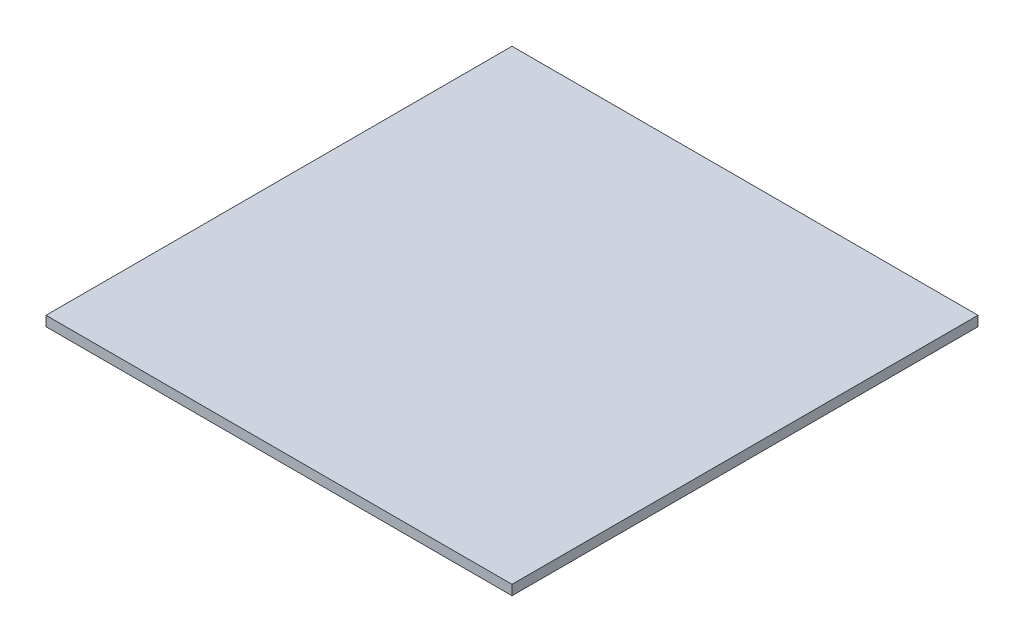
from build123d import *

# Parameters (mm, degrees)
SKETCH1_W           = 470
SKETCH1_H           = 470
BOSS_EXTRUDE1_DEPTH = 10


with BuildPart() as part:
    # Sketch1 → Boss-Extrude1 (new body)
    with BuildSketch(Plane(origin=(0, 0, 0), x_dir=(1, 0, 0), z_dir=(0, 1, 0))):
        with Locations((235, 235)):
            Rectangle(SKETCH1_W, SKETCH1_H)
    extrude(amount=BOSS_EXTRUDE1_DEPTH)


solid = part.part
